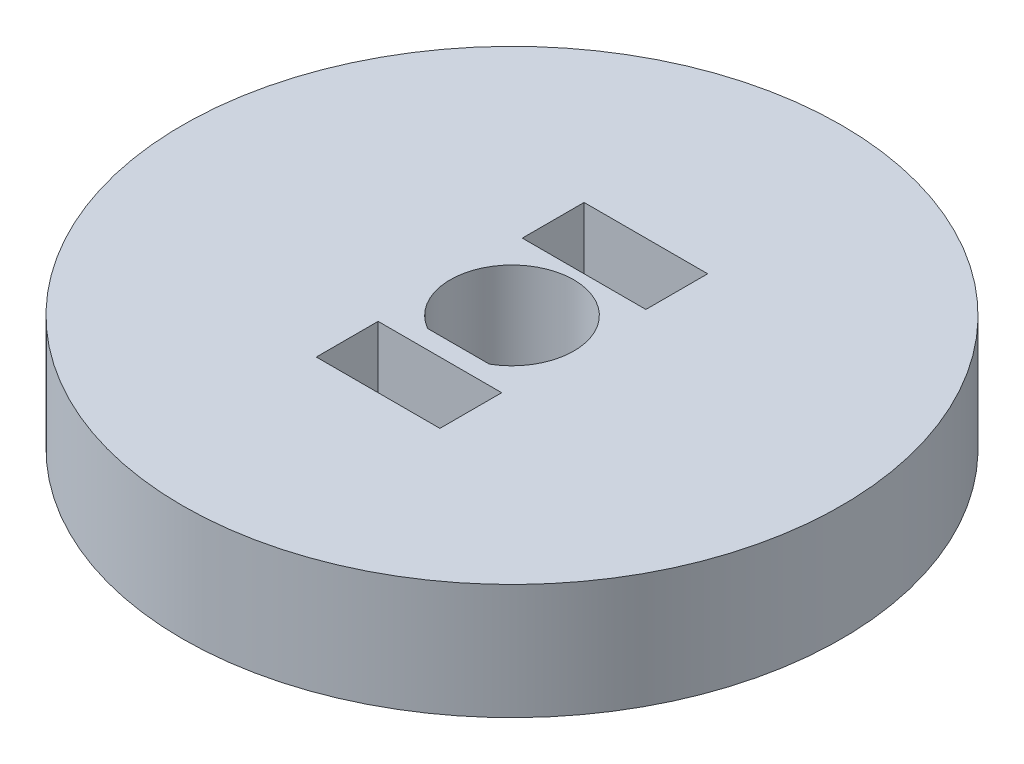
from build123d import *

# Parameters (mm, degrees)
SKETCH_1_R          = 16
EXTRUDE_1_DEPTH     = 5.6
SKETCH_2_W          = 6
SKETCH_2_H          = 3
CUT_EXTRUDE_1_DEPTH = 6


with BuildPart() as part:
    # Sketch 1 → Extrude 1 (new body)
    with BuildSketch(Plane(origin=(0, 0, 0), x_dir=(1, 0, 0), z_dir=(0, 1, 0))):
        with Locations(Location((0, 0, 0), (0, 0, 270))):
            Circle(SKETCH_1_R)
        with BuildLine():
            Line((-1.5, -2.598076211), (1.5, -2.598076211))
            ThreePointArc((1.5, -2.598076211), (0, 3), (-1.5, -2.598076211))
        make_face(mode=Mode.SUBTRACT)
    extrude(amount=EXTRUDE_1_DEPTH)

    # Sketch 2 → Cut-Extrude 1 (cut)
    with BuildSketch(Plane(origin=(0, 5.6, 0), x_dir=(1, 0, 0), z_dir=(0, 1, 0))):
        with Locations((0, -5)):
            Rectangle(SKETCH_2_W, SKETCH_2_H)
        with Locations((0, 5)):
            Rectangle(SKETCH_2_W, SKETCH_2_H)
    extrude(amount=-CUT_EXTRUDE_1_DEPTH, mode=Mode.SUBTRACT)


solid = part.part
